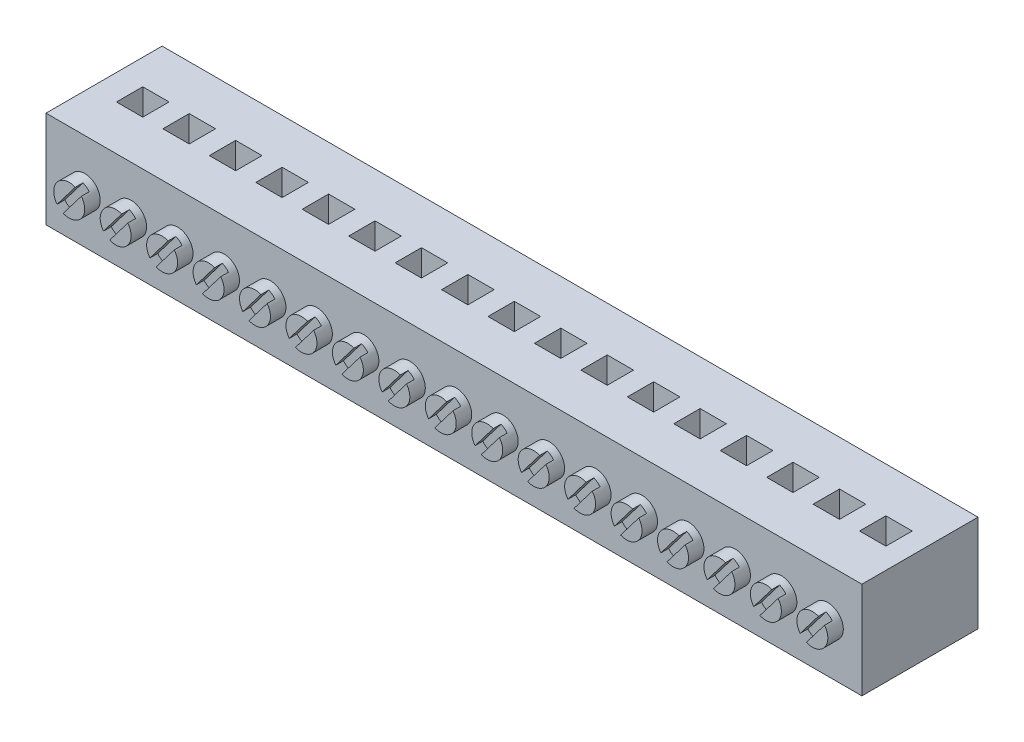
from build123d import *

# Parameters (mm, degrees)
SKETCH1_W        = 133.858
SKETCH1_H        = 15.875
STRIP_BASE_DEPTH = 9.525
SKETCH2_R        = 2.54
SCREW_BODY_DEPTH = 2.54
SCREW_START      = -1.27
SCREW_SLOT_DEPTH = 3.81
SKETCH4_W        = 4.318
SKETCH4_H        = 4.318
WIRE_HOLE_DEPTH  = 70.836028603
LPATTERN1_COUNT  = 17
LPATTERN1_PITCH  = 7.62


with BuildPart() as part:
    # Sketch1 → strip base (new, symmetric)
    with BuildSketch(Plane.XY):
        Rectangle(SKETCH1_W, SKETCH1_H)
    extrude(amount=STRIP_BASE_DEPTH, both=True)

    # Sketch2 → screw body (add)
    with BuildSketch(Plane.XY.offset(9.525)):
        with Locations((-60.579, 0)):
            Circle(SKETCH2_R)
    screw_body = extrude(amount=SCREW_BODY_DEPTH)

    # Sketch3 → screw slot (cut)
    with BuildSketch(Plane.XY.offset(12.065).offset(SCREW_START)):
        Polygon((-59.54496929, 2.405328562), (-62.623299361, -1.635746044), (-61.61303071, -2.405328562), (-58.534700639, 1.635746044), align=None)
    screw_slot = extrude(amount=SCREW_SLOT_DEPTH, mode=Mode.SUBTRACT)

    # Sketch4 → wire hole (cut, through all)
    with BuildSketch(Plane.XZ.offset(7.9375)):
        with Locations((-60.579, 0)):
            Rectangle(SKETCH4_W, SKETCH4_H)
    wire_hole = extrude(amount=-WIRE_HOLE_DEPTH, mode=Mode.SUBTRACT)

    # LPattern1: screw body, screw slot, wire hole ×17
    with Locations(*[(i * LPATTERN1_PITCH, 0, 0) for i in range(1, LPATTERN1_COUNT)]):
        add(screw_body)
        add(screw_slot, mode=Mode.SUBTRACT)
        add(wire_hole, mode=Mode.SUBTRACT)


solid = part.part
